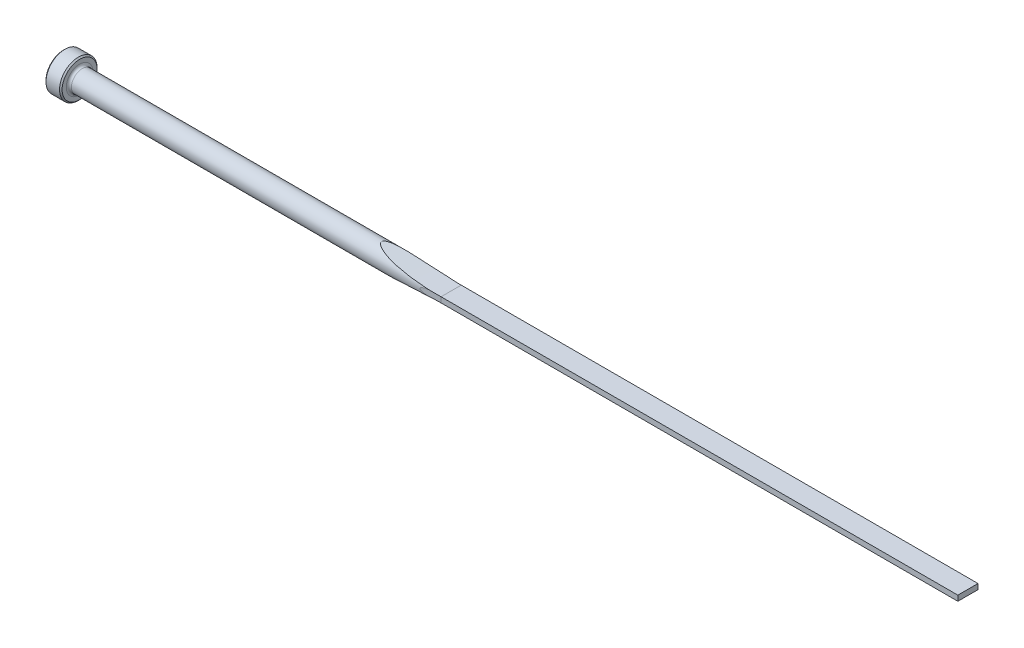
from build123d import *

# Parameters (mm, degrees)
CUT_EXTRUDE1_DEPTH = 267.815465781
CUT_EXTRUDE2_DEPTH = 267.815465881
FILLET1_R          = 0.762
CHAMFER1_SIZE      = 0.381


with BuildPart() as part:
    # Sketch1 → Revolve1 (revolve)
    with BuildSketch(Plane.XY, mode=Mode.PRIVATE) as revolve1_sk:
        Polygon((0, 0), (0, 5.5499), (4.7498, 5.5499), (4.7498, 3.175), (266.7, 3.175), (266.7, 0), align=None)
    revolve(revolve1_sk.sketch.rotate(Axis((0, 0, 0), (1, 0, 0)), 90), axis=Axis((0, 0, 0), (1, 0, 0)))

    # Sketch2 → Cut-Extrude1 (cut, symmetric)
    with BuildSketch(Plane.XY):
        with BuildLine():
            Line((266.7, 3.175), (266.7, 0.7874))
            Line((266.7, 0.7874), (114.3, 0.7874))
            ThreePointArc((114.3, 0.7874), (103.998115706, 1.386317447), (93.835038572, 3.175))
            Line((93.835038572, 3.175), (266.7, 3.175))
        make_face()
    cut_extrude1 = extrude(amount=CUT_EXTRUDE1_DEPTH, both=True, mode=Mode.SUBTRACT)

    # Mirror1: Cut-Extrude1 across plane
    add(cut_extrude1.mirror(Plane.ZX), mode=Mode.SUBTRACT)

    # Sketch3 → Cut-Extrude2 (cut, symmetric)
    with BuildSketch(Plane(origin=(0, 0, 0), x_dir=(1, 0, 0), z_dir=(0, 1, 0))):
        with BuildLine():
            Line((266.7, 3.175), (266.7, 2.9718))
            Line((266.7, 2.9718), (114.3, 2.9718))
            ThreePointArc((114.3, 2.9718), (111.29463147, 3.022614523), (108.292698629, 3.175))
            Line((108.292698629, 3.175), (266.7, 3.175))
        make_face()
    cut_extrude2 = extrude(amount=CUT_EXTRUDE2_DEPTH, both=True, mode=Mode.SUBTRACT)

    # Mirror2: Cut-Extrude2 across plane
    add(cut_extrude2.mirror(Plane.XY), mode=Mode.SUBTRACT)

    # Fillet1
    fillet1_edges = [part.edges().sort_by_distance(p)[0] for p in [
        (4.7498, 0, -3.175),
    ]]
    fillet(fillet1_edges, radius=FILLET1_R)

    # Chamfer1
    chamfer1_edges = [part.edges().sort_by_distance(p)[0] for p in [
        (4.7498, 0, -5.5499),
        (0, 0, -5.5499),
    ]]
    chamfer(chamfer1_edges, length=CHAMFER1_SIZE)


solid = part.part
